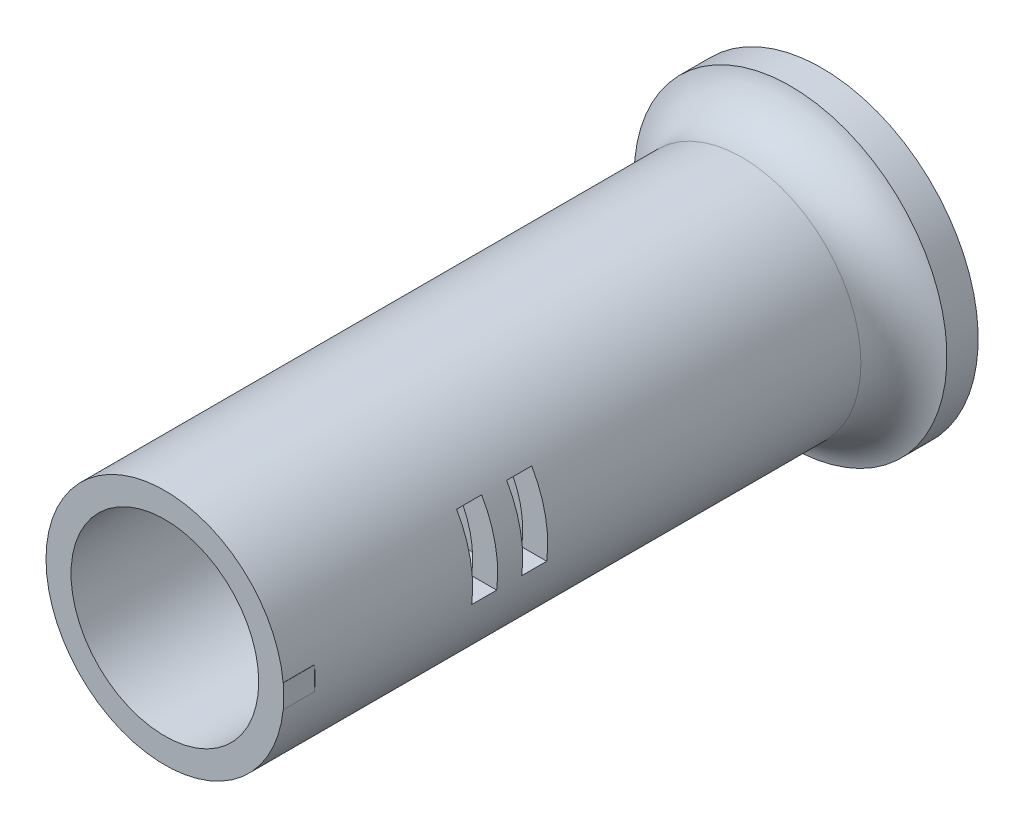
ISO-10303-21;
HEADER;
FILE_DESCRIPTION(('STEP AP214'),'2;1');
FILE_NAME('part.step','',(''),(''),'','','');
FILE_SCHEMA(('AUTOMOTIVE_DESIGN { 1 0 10303 214 1 1 1 1 }'));
ENDSEC;
DATA;
#1=APPLICATION_CONTEXT('core data for automotive mechanical design processes');
#2=APPLICATION_PROTOCOL_DEFINITION('international standard','automotive_design',2000,#1);
#3=PRODUCT_CONTEXT('',#1,'mechanical');
#4=PRODUCT('Part','Part','',(#3));
#5=PRODUCT_RELATED_PRODUCT_CATEGORY('part','',(#4));
#6=PRODUCT_DEFINITION_FORMATION('','',#4);
#7=PRODUCT_DEFINITION_CONTEXT('part definition',#1,'design');
#8=PRODUCT_DEFINITION('design','',#6,#7);
#9=PRODUCT_DEFINITION_SHAPE('','',#8);
#10=(LENGTH_UNIT() NAMED_UNIT(*) SI_UNIT(.MILLI.,.METRE.));
#11=(NAMED_UNIT(*) PLANE_ANGLE_UNIT() SI_UNIT($,.RADIAN.));
#12=(NAMED_UNIT(*) SI_UNIT($,.STERADIAN.) SOLID_ANGLE_UNIT());
#13=UNCERTAINTY_MEASURE_WITH_UNIT(LENGTH_MEASURE(1.E-05),#10,'distance_accuracy_value','');
#14=(GEOMETRIC_REPRESENTATION_CONTEXT(3) GLOBAL_UNCERTAINTY_ASSIGNED_CONTEXT((#13)) GLOBAL_UNIT_ASSIGNED_CONTEXT((#10,
#11,#12)) REPRESENTATION_CONTEXT('',''));
#15=CARTESIAN_POINT('',(0.,0.,0.));
#16=DIRECTION('',(0.,0.,1.));
#17=DIRECTION('',(1.,0.,0.));
#18=AXIS2_PLACEMENT_3D('',#15,#16,#17);
#19=CARTESIAN_POINT('',(0.,0.,120.65));
#20=DIRECTION('',(0.,0.,-1.));
#21=DIRECTION('',(-1.,0.,0.));
#22=AXIS2_PLACEMENT_3D('',#19,#20,#21);
#23=PLANE('',#22);
#24=DIRECTION('',(0.,1.,0.));
#25=VECTOR('',#24,1.);
#26=CARTESIAN_POINT('',(24.0565975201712,2.35496310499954,120.65));
#27=LINE('',#26,#25);
#28=CARTESIAN_POINT('',(24.0565975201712,-2.35496310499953,120.65));
#29=VERTEX_POINT('',#28);
#30=CARTESIAN_POINT('',(24.0565975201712,-1.88069555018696,120.65));
#31=VERTEX_POINT('',#30);
#32=EDGE_CURVE('E147',#29,#31,#27,.T.);
#33=ORIENTED_EDGE('',*,*,#32,.F.);
#34=DIRECTION('',(1.,0.,0.));
#35=VECTOR('',#34,1.);
#36=CARTESIAN_POINT('',(24.0148089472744,-2.35496310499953,120.65));
#37=LINE('',#36,#35);
#38=CARTESIAN_POINT('',(24.0148089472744,-2.35496310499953,120.65));
#39=VERTEX_POINT('',#38);
#40=EDGE_CURVE('E153',#39,#29,#37,.T.);
#41=ORIENTED_EDGE('',*,*,#40,.F.);
#42=CARTESIAN_POINT('',(0.,0.,120.65));
#43=DIRECTION('',(0.,0.,-1.));
#44=DIRECTION('',(-1.,0.,0.));
#45=AXIS2_PLACEMENT_3D('',#42,#43,#44);
#46=CIRCLE('',#45,24.13);
#47=EDGE_CURVE('E199',#31,#39,#46,.T.);
#48=ORIENTED_EDGE('',*,*,#47,.F.);
#49=EDGE_LOOP('',(#33,#41,#48));
#50=FACE_BOUND('',#49,.T.);
#51=ADVANCED_FACE('F38',(#50),#23,.T.);
#52=CARTESIAN_POINT('',(0.,0.,127.));
#53=DIRECTION('',(0.,0.,-1.));
#54=DIRECTION('',(-1.,0.,0.));
#55=AXIS2_PLACEMENT_3D('',#52,#53,#54);
#56=CYLINDRICAL_SURFACE('',#55,24.13);
#57=DIRECTION('',(0.,0.,-1.));
#58=VECTOR('',#57,1.);
#59=CARTESIAN_POINT('',(23.9259508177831,-3.13141780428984,127.));
#60=LINE('',#59,#58);
#61=CARTESIAN_POINT('',(23.9259508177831,-3.13141780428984,83.5679729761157));
#62=VERTEX_POINT('',#61);
#63=CARTESIAN_POINT('',(23.9259508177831,-3.13141780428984,88.6479729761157));
#64=VERTEX_POINT('',#63);
#65=EDGE_CURVE('E293',#62,#64,#60,.F.);
#66=ORIENTED_EDGE('',*,*,#65,.T.);
#67=CARTESIAN_POINT('',(0.,0.,88.6479729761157));
#68=DIRECTION('',(0.,0.,1.));
#69=DIRECTION('',(1.,0.,0.));
#70=AXIS2_PLACEMENT_3D('',#67,#68,#69);
#71=CIRCLE('',#70,24.13);
#72=CARTESIAN_POINT('',(20.8719701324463,12.1085821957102,88.6479729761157));
#73=VERTEX_POINT('',#72);
#74=EDGE_CURVE('E164',#64,#73,#71,.T.);
#75=ORIENTED_EDGE('',*,*,#74,.T.);
#76=DIRECTION('',(0.,0.,-1.));
#77=VECTOR('',#76,1.);
#78=CARTESIAN_POINT('',(20.8719701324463,12.1085821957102,127.));
#79=LINE('',#78,#77);
#80=CARTESIAN_POINT('',(20.8719701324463,12.1085821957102,83.5679729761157));
#81=VERTEX_POINT('',#80);
#82=EDGE_CURVE('E246',#73,#81,#79,.T.);
#83=ORIENTED_EDGE('',*,*,#82,.T.);
#84=CARTESIAN_POINT('',(0.,0.,83.5679729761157));
#85=DIRECTION('',(0.,0.,-1.));
#86=DIRECTION('',(-1.,0.,0.));
#87=AXIS2_PLACEMENT_3D('',#84,#85,#86);
#88=CIRCLE('',#87,24.13);
#89=EDGE_CURVE('E297',#81,#62,#88,.T.);
#90=ORIENTED_EDGE('',*,*,#89,.T.);
#91=EDGE_LOOP('',(#66,#75,#83,#90));
#92=FACE_BOUND('',#91,.T.);
#93=DIRECTION('',(0.,0.,-1.));
#94=VECTOR('',#93,1.);
#95=CARTESIAN_POINT('',(23.9259508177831,-3.13141780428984,127.));
#96=LINE('',#95,#94);
#97=CARTESIAN_POINT('',(23.9259508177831,-3.13141780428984,73.4079729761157));
#98=VERTEX_POINT('',#97);
#99=CARTESIAN_POINT('',(23.9259508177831,-3.13141780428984,78.4879729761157));
#100=VERTEX_POINT('',#99);
#101=EDGE_CURVE('E248',#98,#100,#96,.F.);
#102=ORIENTED_EDGE('',*,*,#101,.T.);
#103=CARTESIAN_POINT('',(0.,0.,78.4879729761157));
#104=DIRECTION('',(0.,0.,1.));
#105=DIRECTION('',(1.,0.,0.));
#106=AXIS2_PLACEMENT_3D('',#103,#104,#105);
#107=CIRCLE('',#106,24.13);
#108=CARTESIAN_POINT('',(20.8719701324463,12.1085821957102,78.4879729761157));
#109=VERTEX_POINT('',#108);
#110=EDGE_CURVE('E289',#100,#109,#107,.T.);
#111=ORIENTED_EDGE('',*,*,#110,.T.);
#112=DIRECTION('',(0.,0.,-1.));
#113=VECTOR('',#112,1.);
#114=CARTESIAN_POINT('',(20.8719701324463,12.1085821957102,127.));
#115=LINE('',#114,#113);
#116=CARTESIAN_POINT('',(20.8719701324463,12.1085821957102,73.4079729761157));
#117=VERTEX_POINT('',#116);
#118=EDGE_CURVE('E285',#109,#117,#115,.T.);
#119=ORIENTED_EDGE('',*,*,#118,.T.);
#120=CARTESIAN_POINT('',(0.,0.,73.4079729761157));
#121=DIRECTION('',(0.,0.,-1.));
#122=DIRECTION('',(-1.,0.,0.));
#123=AXIS2_PLACEMENT_3D('',#120,#121,#122);
#124=CIRCLE('',#123,24.13);
#125=EDGE_CURVE('E254',#117,#98,#124,.T.);
#126=ORIENTED_EDGE('',*,*,#125,.T.);
#127=EDGE_LOOP('',(#102,#111,#119,#126));
#128=FACE_BOUND('',#127,.T.);
#129=CARTESIAN_POINT('',(0.,0.,127.));
#130=DIRECTION('',(0.,0.,1.));
#131=DIRECTION('',(1.,0.,0.));
#132=AXIS2_PLACEMENT_3D('',#129,#130,#131);
#133=CIRCLE('',#132,24.13);
#134=CARTESIAN_POINT('',(24.0148089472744,2.35496310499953,127.));
#135=VERTEX_POINT('',#134);
#136=CARTESIAN_POINT('',(24.0148089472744,-2.35496310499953,127.));
#137=VERTEX_POINT('',#136);
#138=EDGE_CURVE('E188',#135,#137,#133,.T.);
#139=ORIENTED_EDGE('',*,*,#138,.F.);
#140=DIRECTION('',(0.,0.,1.));
#141=VECTOR('',#140,1.);
#142=CARTESIAN_POINT('',(24.0148089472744,2.35496310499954,120.65));
#143=LINE('',#142,#141);
#144=CARTESIAN_POINT('',(24.0148089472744,2.35496310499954,120.65));
#145=VERTEX_POINT('',#144);
#146=EDGE_CURVE('E159',#145,#135,#143,.T.);
#147=ORIENTED_EDGE('',*,*,#146,.F.);
#148=CARTESIAN_POINT('',(24.0565975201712,1.88069555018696,120.65));
#149=VERTEX_POINT('',#148);
#150=EDGE_CURVE('E150',#145,#149,#46,.T.);
#151=ORIENTED_EDGE('',*,*,#150,.T.);
#152=EDGE_CURVE('E203',#149,#31,#46,.T.);
#153=ORIENTED_EDGE('',*,*,#152,.T.);
#154=ORIENTED_EDGE('',*,*,#47,.T.);
#155=DIRECTION('',(0.,0.,1.));
#156=VECTOR('',#155,1.);
#157=CARTESIAN_POINT('',(24.0148089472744,-2.35496310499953,120.65));
#158=LINE('',#157,#156);
#159=EDGE_CURVE('E169',#39,#137,#158,.T.);
#160=ORIENTED_EDGE('',*,*,#159,.T.);
#161=EDGE_LOOP('',(#139,#147,#151,#153,#154,#160));
#162=FACE_BOUND('',#161,.T.);
#163=CARTESIAN_POINT('',(0.,0.,9.83737769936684));
#164=DIRECTION('',(0.,0.,-1.));
#165=DIRECTION('',(-1.,0.,0.));
#166=AXIS2_PLACEMENT_3D('',#163,#164,#165);
#167=CIRCLE('',#166,24.13);
#168=CARTESIAN_POINT('',(-24.13,0.,9.83737769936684));
#169=VERTEX_POINT('',#168);
#170=EDGE_CURVE('E195',#169,#169,#167,.F.);
#171=ORIENTED_EDGE('',*,*,#170,.T.);
#172=EDGE_LOOP('',(#171));
#173=FACE_BOUND('',#172,.T.);
#174=ADVANCED_FACE('F303',(#92,#128,#162,#173),#56,.T.);
#175=CARTESIAN_POINT('',(0.,0.,127.));
#176=DIRECTION('',(0.,0.,1.));
#177=DIRECTION('',(1.,0.,0.));
#178=AXIS2_PLACEMENT_3D('',#175,#176,#177);
#179=PLANE('',#178);
#180=DIRECTION('',(0.,-1.,0.));
#181=VECTOR('',#180,1.);
#182=CARTESIAN_POINT('',(24.0565975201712,2.35496310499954,127.));
#183=LINE('',#182,#181);
#184=CARTESIAN_POINT('',(24.0565975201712,2.35496310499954,127.));
#185=VERTEX_POINT('',#184);
#186=CARTESIAN_POINT('',(24.0565975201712,-2.35496310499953,127.));
#187=VERTEX_POINT('',#186);
#188=EDGE_CURVE('E146',#185,#187,#183,.T.);
#189=ORIENTED_EDGE('',*,*,#188,.F.);
#190=DIRECTION('',(-1.,0.,0.));
#191=VECTOR('',#190,1.);
#192=CARTESIAN_POINT('',(24.0148089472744,2.35496310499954,127.));
#193=LINE('',#192,#191);
#194=EDGE_CURVE('E144',#185,#135,#193,.T.);
#195=ORIENTED_EDGE('',*,*,#194,.T.);
#196=ORIENTED_EDGE('',*,*,#138,.T.);
#197=DIRECTION('',(1.,0.,0.));
#198=VECTOR('',#197,1.);
#199=CARTESIAN_POINT('',(24.0148089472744,-2.35496310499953,127.));
#200=LINE('',#199,#198);
#201=EDGE_CURVE('E154',#137,#187,#200,.T.);
#202=ORIENTED_EDGE('',*,*,#201,.T.);
#203=EDGE_LOOP('',(#189,#195,#196,#202));
#204=FACE_BOUND('',#203,.T.);
#205=CARTESIAN_POINT('',(0.,0.,127.));
#206=DIRECTION('',(0.,0.,1.));
#207=DIRECTION('',(1.,0.,0.));
#208=AXIS2_PLACEMENT_3D('',#205,#206,#207);
#209=CIRCLE('',#208,19.05);
#210=CARTESIAN_POINT('',(19.05,0.,127.));
#211=VERTEX_POINT('',#210);
#212=EDGE_CURVE('E180',#211,#211,#209,.T.);
#213=ORIENTED_EDGE('',*,*,#212,.F.);
#214=EDGE_LOOP('',(#213));
#215=FACE_BOUND('',#214,.T.);
#216=ADVANCED_FACE('F324',(#204,#215),#179,.T.);
#217=CARTESIAN_POINT('',(0.,0.,63.5));
#218=DIRECTION('',(0.,0.,1.));
#219=DIRECTION('',(1.,0.,0.));
#220=AXIS2_PLACEMENT_3D('',#217,#218,#219);
#221=CYLINDRICAL_SURFACE('',#220,19.05);
#222=DIRECTION('',(0.,0.,1.));
#223=VECTOR('',#222,1.);
#224=CARTESIAN_POINT('',(14.7066222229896,12.1085821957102,63.5));
#225=LINE('',#224,#223);
#226=CARTESIAN_POINT('',(14.7066222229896,12.1085821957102,83.5679729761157));
#227=VERTEX_POINT('',#226);
#228=CARTESIAN_POINT('',(14.7066222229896,12.1085821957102,88.6479729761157));
#229=VERTEX_POINT('',#228);
#230=EDGE_CURVE('E227',#227,#229,#225,.T.);
#231=ORIENTED_EDGE('',*,*,#230,.T.);
#232=CARTESIAN_POINT('',(0.,0.,88.6479729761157));
#233=DIRECTION('',(0.,0.,1.));
#234=DIRECTION('',(1.,0.,0.));
#235=AXIS2_PLACEMENT_3D('',#232,#233,#234);
#236=CIRCLE('',#235,19.05);
#237=CARTESIAN_POINT('',(18.7908680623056,-3.13141780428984,88.6479729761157));
#238=VERTEX_POINT('',#237);
#239=EDGE_CURVE('E47',#229,#238,#236,.F.);
#240=ORIENTED_EDGE('',*,*,#239,.T.);
#241=DIRECTION('',(0.,0.,1.));
#242=VECTOR('',#241,1.);
#243=CARTESIAN_POINT('',(18.7908680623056,-3.13141780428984,63.5));
#244=LINE('',#243,#242);
#245=CARTESIAN_POINT('',(18.7908680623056,-3.13141780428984,83.5679729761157));
#246=VERTEX_POINT('',#245);
#247=EDGE_CURVE('E219',#238,#246,#244,.F.);
#248=ORIENTED_EDGE('',*,*,#247,.T.);
#249=CARTESIAN_POINT('',(0.,0.,83.5679729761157));
#250=DIRECTION('',(0.,0.,-1.));
#251=DIRECTION('',(-1.,0.,0.));
#252=AXIS2_PLACEMENT_3D('',#249,#250,#251);
#253=CIRCLE('',#252,19.05);
#254=EDGE_CURVE('E223',#246,#227,#253,.F.);
#255=ORIENTED_EDGE('',*,*,#254,.T.);
#256=EDGE_LOOP('',(#231,#240,#248,#255));
#257=FACE_BOUND('',#256,.T.);
#258=DIRECTION('',(0.,0.,1.));
#259=VECTOR('',#258,1.);
#260=CARTESIAN_POINT('',(14.7066222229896,12.1085821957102,63.5));
#261=LINE('',#260,#259);
#262=CARTESIAN_POINT('',(14.7066222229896,12.1085821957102,73.4079729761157));
#263=VERTEX_POINT('',#262);
#264=CARTESIAN_POINT('',(14.7066222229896,12.1085821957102,78.4879729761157));
#265=VERTEX_POINT('',#264);
#266=EDGE_CURVE('E211',#263,#265,#261,.T.);
#267=ORIENTED_EDGE('',*,*,#266,.T.);
#268=CARTESIAN_POINT('',(0.,0.,78.4879729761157));
#269=DIRECTION('',(0.,0.,1.));
#270=DIRECTION('',(1.,0.,0.));
#271=AXIS2_PLACEMENT_3D('',#268,#269,#270);
#272=CIRCLE('',#271,19.05);
#273=CARTESIAN_POINT('',(18.7908680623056,-3.13141780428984,78.4879729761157));
#274=VERTEX_POINT('',#273);
#275=EDGE_CURVE('E215',#265,#274,#272,.F.);
#276=ORIENTED_EDGE('',*,*,#275,.T.);
#277=DIRECTION('',(0.,0.,1.));
#278=VECTOR('',#277,1.);
#279=CARTESIAN_POINT('',(18.7908680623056,-3.13141780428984,63.5));
#280=LINE('',#279,#278);
#281=CARTESIAN_POINT('',(18.7908680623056,-3.13141780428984,73.4079729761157));
#282=VERTEX_POINT('',#281);
#283=EDGE_CURVE('E202',#274,#282,#280,.F.);
#284=ORIENTED_EDGE('',*,*,#283,.T.);
#285=CARTESIAN_POINT('',(0.,0.,73.4079729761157));
#286=DIRECTION('',(0.,0.,-1.));
#287=DIRECTION('',(-1.,0.,0.));
#288=AXIS2_PLACEMENT_3D('',#285,#286,#287);
#289=CIRCLE('',#288,19.05);
#290=EDGE_CURVE('E207',#282,#263,#289,.F.);
#291=ORIENTED_EDGE('',*,*,#290,.T.);
#292=EDGE_LOOP('',(#267,#276,#284,#291));
#293=FACE_BOUND('',#292,.T.);
#294=CARTESIAN_POINT('',(0.,0.,63.5));
#295=DIRECTION('',(0.,0.,1.));
#296=DIRECTION('',(1.,0.,0.));
#297=AXIS2_PLACEMENT_3D('',#294,#295,#296);
#298=CIRCLE('',#297,19.05);
#299=CARTESIAN_POINT('',(19.05,0.,63.5));
#300=VERTEX_POINT('',#299);
#301=EDGE_CURVE('E184',#300,#300,#298,.T.);
#302=ORIENTED_EDGE('',*,*,#301,.F.);
#303=EDGE_LOOP('',(#302));
#304=FACE_BOUND('',#303,.T.);
#305=ORIENTED_EDGE('',*,*,#212,.T.);
#306=EDGE_LOOP('',(#305));
#307=FACE_BOUND('',#306,.T.);
#308=ADVANCED_FACE('F233',(#257,#293,#304,#307),#221,.F.);
#309=CARTESIAN_POINT('',(0.,0.,63.5));
#310=DIRECTION('',(0.,0.,1.));
#311=DIRECTION('',(1.,0.,0.));
#312=AXIS2_PLACEMENT_3D('',#309,#310,#311);
#313=PLANE('',#312);
#314=ORIENTED_EDGE('',*,*,#301,.T.);
#315=EDGE_LOOP('',(#314));
#316=FACE_BOUND('',#315,.T.);
#317=ADVANCED_FACE('F351',(#316),#313,.T.);
#318=CARTESIAN_POINT('',(0.,0.,-6.35));
#319=DIRECTION('',(0.,0.,1.));
#320=DIRECTION('',(1.,0.,0.));
#321=AXIS2_PLACEMENT_3D('',#318,#319,#320);
#322=CYLINDRICAL_SURFACE('',#321,31.75);
#323=CARTESIAN_POINT('',(0.,0.,-6.35));
#324=DIRECTION('',(0.,0.,-1.));
#325=DIRECTION('',(-1.,0.,0.));
#326=AXIS2_PLACEMENT_3D('',#323,#324,#325);
#327=CIRCLE('',#326,31.75);
#328=CARTESIAN_POINT('',(-31.75,0.,-6.35));
#329=VERTEX_POINT('',#328);
#330=EDGE_CURVE('E176',#329,#329,#327,.T.);
#331=ORIENTED_EDGE('',*,*,#330,.F.);
#332=EDGE_LOOP('',(#331));
#333=FACE_BOUND('',#332,.T.);
#334=CARTESIAN_POINT('',(0.,0.,0.));
#335=DIRECTION('',(0.,0.,-1.));
#336=DIRECTION('',(-1.,0.,0.));
#337=AXIS2_PLACEMENT_3D('',#334,#335,#336);
#338=CIRCLE('',#337,31.75);
#339=CARTESIAN_POINT('',(-31.75,0.,0.));
#340=VERTEX_POINT('',#339);
#341=EDGE_CURVE('E173',#340,#340,#338,.T.);
#342=ORIENTED_EDGE('',*,*,#341,.T.);
#343=EDGE_LOOP('',(#342));
#344=FACE_BOUND('',#343,.T.);
#345=ADVANCED_FACE('F347',(#333,#344),#322,.T.);
#346=CARTESIAN_POINT('',(0.,0.,-6.35));
#347=DIRECTION('',(0.,0.,-1.));
#348=DIRECTION('',(-1.,0.,0.));
#349=AXIS2_PLACEMENT_3D('',#346,#347,#348);
#350=PLANE('',#349);
#351=ORIENTED_EDGE('',*,*,#330,.T.);
#352=EDGE_LOOP('',(#351));
#353=FACE_BOUND('',#352,.T.);
#354=ADVANCED_FACE('F344',(#353),#350,.T.);
#355=CARTESIAN_POINT('',(0.,0.,9.83737769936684));
#356=DIRECTION('',(0.,0.,-1.));
#357=DIRECTION('',(-1.,0.,0.));
#358=AXIS2_PLACEMENT_3D('',#355,#356,#357);
#359=TOROIDAL_SURFACE('',#358,34.29,10.16);
#360=ORIENTED_EDGE('',*,*,#341,.F.);
#361=EDGE_LOOP('',(#360));
#362=FACE_BOUND('',#361,.T.);
#363=ORIENTED_EDGE('',*,*,#170,.F.);
#364=EDGE_LOOP('',(#363));
#365=FACE_BOUND('',#364,.T.);
#366=ADVANCED_FACE('F40',(#362,#365),#359,.F.);
#367=CARTESIAN_POINT('',(24.0148089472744,2.35496310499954,120.65));
#368=DIRECTION('',(0.,1.,0.));
#369=DIRECTION('',(0.,0.,1.));
#370=AXIS2_PLACEMENT_3D('',#367,#368,#369);
#371=PLANE('',#370);
#372=DIRECTION('',(0.,0.,1.));
#373=VECTOR('',#372,1.);
#374=CARTESIAN_POINT('',(24.0565975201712,2.35496310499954,120.65));
#375=LINE('',#374,#373);
#376=CARTESIAN_POINT('',(24.0565975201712,2.35496310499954,120.65));
#377=VERTEX_POINT('',#376);
#378=EDGE_CURVE('E133',#377,#185,#375,.T.);
#379=ORIENTED_EDGE('',*,*,#378,.F.);
#380=DIRECTION('',(-1.,0.,0.));
#381=VECTOR('',#380,1.);
#382=CARTESIAN_POINT('',(24.0148089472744,2.35496310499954,120.65));
#383=LINE('',#382,#381);
#384=EDGE_CURVE('E143',#377,#145,#383,.T.);
#385=ORIENTED_EDGE('',*,*,#384,.T.);
#386=ORIENTED_EDGE('',*,*,#146,.T.);
#387=ORIENTED_EDGE('',*,*,#194,.F.);
#388=EDGE_LOOP('',(#379,#385,#386,#387));
#389=FACE_BOUND('',#388,.T.);
#390=ADVANCED_FACE('F141',(#389),#371,.T.);
#391=CARTESIAN_POINT('',(24.0148089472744,-2.35496310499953,120.65));
#392=DIRECTION('',(0.,-1.,0.));
#393=DIRECTION('',(0.,0.,-1.));
#394=AXIS2_PLACEMENT_3D('',#391,#392,#393);
#395=PLANE('',#394);
#396=DIRECTION('',(0.,0.,-1.));
#397=VECTOR('',#396,1.);
#398=CARTESIAN_POINT('',(24.0565975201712,-2.35496310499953,120.65));
#399=LINE('',#398,#397);
#400=EDGE_CURVE('E259',#187,#29,#399,.T.);
#401=ORIENTED_EDGE('',*,*,#400,.F.);
#402=ORIENTED_EDGE('',*,*,#201,.F.);
#403=ORIENTED_EDGE('',*,*,#159,.F.);
#404=ORIENTED_EDGE('',*,*,#40,.T.);
#405=EDGE_LOOP('',(#401,#402,#403,#404));
#406=FACE_BOUND('',#405,.T.);
#407=ADVANCED_FACE('F330',(#406),#395,.T.);
#408=DIRECTION('',(0.,1.,0.));
#409=VECTOR('',#408,1.);
#410=CARTESIAN_POINT('',(24.0565975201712,0.,120.65));
#411=LINE('',#410,#409);
#412=EDGE_CURVE('E11',#149,#377,#411,.T.);
#413=ORIENTED_EDGE('',*,*,#412,.F.);
#414=ORIENTED_EDGE('',*,*,#150,.F.);
#415=ORIENTED_EDGE('',*,*,#384,.F.);
#416=EDGE_LOOP('',(#413,#414,#415));
#417=FACE_BOUND('',#416,.T.);
#418=ADVANCED_FACE('F149',(#417),#23,.T.);
#419=CARTESIAN_POINT('',(8.6260975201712,12.1085821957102,78.4879729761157));
#420=DIRECTION('',(0.,0.,1.));
#421=DIRECTION('',(1.,0.,0.));
#422=AXIS2_PLACEMENT_3D('',#419,#420,#421);
#423=PLANE('',#422);
#424=DIRECTION('',(1.,0.,0.));
#425=VECTOR('',#424,1.);
#426=CARTESIAN_POINT('',(8.6260975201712,-3.13141780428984,78.4879729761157));
#427=LINE('',#426,#425);
#428=EDGE_CURVE('E279',#274,#100,#427,.T.);
#429=ORIENTED_EDGE('',*,*,#428,.F.);
#430=ORIENTED_EDGE('',*,*,#275,.F.);
#431=DIRECTION('',(1.,0.,0.));
#432=VECTOR('',#431,1.);
#433=CARTESIAN_POINT('',(8.6260975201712,12.1085821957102,78.4879729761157));
#434=LINE('',#433,#432);
#435=EDGE_CURVE('E267',#265,#109,#434,.T.);
#436=ORIENTED_EDGE('',*,*,#435,.T.);
#437=ORIENTED_EDGE('',*,*,#110,.F.);
#438=EDGE_LOOP('',(#429,#430,#436,#437));
#439=FACE_BOUND('',#438,.T.);
#440=ADVANCED_FACE('F329',(#439),#423,.F.);
#441=CARTESIAN_POINT('',(8.6260975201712,12.1085821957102,78.4879729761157));
#442=DIRECTION('',(0.,1.,0.));
#443=DIRECTION('',(0.,0.,1.));
#444=AXIS2_PLACEMENT_3D('',#441,#442,#443);
#445=PLANE('',#444);
#446=ORIENTED_EDGE('',*,*,#435,.F.);
#447=ORIENTED_EDGE('',*,*,#266,.F.);
#448=DIRECTION('',(1.,0.,0.));
#449=VECTOR('',#448,1.);
#450=CARTESIAN_POINT('',(8.6260975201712,12.1085821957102,73.4079729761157));
#451=LINE('',#450,#449);
#452=EDGE_CURVE('E271',#263,#117,#451,.T.);
#453=ORIENTED_EDGE('',*,*,#452,.T.);
#454=ORIENTED_EDGE('',*,*,#118,.F.);
#455=EDGE_LOOP('',(#446,#447,#453,#454));
#456=FACE_BOUND('',#455,.T.);
#457=ADVANCED_FACE('F335',(#456),#445,.F.);
#458=CARTESIAN_POINT('',(8.6260975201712,12.1085821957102,73.4079729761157));
#459=DIRECTION('',(0.,0.,-1.));
#460=DIRECTION('',(-1.,0.,0.));
#461=AXIS2_PLACEMENT_3D('',#458,#459,#460);
#462=PLANE('',#461);
#463=ORIENTED_EDGE('',*,*,#452,.F.);
#464=ORIENTED_EDGE('',*,*,#290,.F.);
#465=DIRECTION('',(1.,0.,0.));
#466=VECTOR('',#465,1.);
#467=CARTESIAN_POINT('',(8.6260975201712,-3.13141780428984,73.4079729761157));
#468=LINE('',#467,#466);
#469=EDGE_CURVE('E275',#282,#98,#468,.T.);
#470=ORIENTED_EDGE('',*,*,#469,.T.);
#471=ORIENTED_EDGE('',*,*,#125,.F.);
#472=EDGE_LOOP('',(#463,#464,#470,#471));
#473=FACE_BOUND('',#472,.T.);
#474=ADVANCED_FACE('F458',(#473),#462,.F.);
#475=CARTESIAN_POINT('',(8.6260975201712,-3.13141780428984,78.4879729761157));
#476=DIRECTION('',(0.,-1.,0.));
#477=DIRECTION('',(0.,0.,-1.));
#478=AXIS2_PLACEMENT_3D('',#475,#476,#477);
#479=PLANE('',#478);
#480=ORIENTED_EDGE('',*,*,#469,.F.);
#481=ORIENTED_EDGE('',*,*,#283,.F.);
#482=ORIENTED_EDGE('',*,*,#428,.T.);
#483=ORIENTED_EDGE('',*,*,#101,.F.);
#484=EDGE_LOOP('',(#480,#481,#482,#483));
#485=FACE_BOUND('',#484,.T.);
#486=ADVANCED_FACE('F449',(#485),#479,.F.);
#487=CARTESIAN_POINT('',(8.6260975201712,12.1085821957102,88.6479729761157));
#488=DIRECTION('',(0.,0.,1.));
#489=DIRECTION('',(1.,0.,0.));
#490=AXIS2_PLACEMENT_3D('',#487,#488,#489);
#491=PLANE('',#490);
#492=DIRECTION('',(1.,0.,0.));
#493=VECTOR('',#492,1.);
#494=CARTESIAN_POINT('',(8.6260975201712,-3.13141780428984,88.6479729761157));
#495=LINE('',#494,#493);
#496=EDGE_CURVE('E61',#238,#64,#495,.T.);
#497=ORIENTED_EDGE('',*,*,#496,.F.);
#498=ORIENTED_EDGE('',*,*,#239,.F.);
#499=DIRECTION('',(1.,0.,0.));
#500=VECTOR('',#499,1.);
#501=CARTESIAN_POINT('',(8.6260975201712,12.1085821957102,88.6479729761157));
#502=LINE('',#501,#500);
#503=EDGE_CURVE('E239',#229,#73,#502,.T.);
#504=ORIENTED_EDGE('',*,*,#503,.T.);
#505=ORIENTED_EDGE('',*,*,#74,.F.);
#506=EDGE_LOOP('',(#497,#498,#504,#505));
#507=FACE_BOUND('',#506,.T.);
#508=ADVANCED_FACE('F238',(#507),#491,.F.);
#509=CARTESIAN_POINT('',(8.6260975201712,12.1085821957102,88.6479729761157));
#510=DIRECTION('',(0.,1.,0.));
#511=DIRECTION('',(0.,0.,1.));
#512=AXIS2_PLACEMENT_3D('',#509,#510,#511);
#513=PLANE('',#512);
#514=ORIENTED_EDGE('',*,*,#503,.F.);
#515=ORIENTED_EDGE('',*,*,#230,.F.);
#516=DIRECTION('',(1.,0.,0.));
#517=VECTOR('',#516,1.);
#518=CARTESIAN_POINT('',(8.6260975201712,12.1085821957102,83.5679729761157));
#519=LINE('',#518,#517);
#520=EDGE_CURVE('E249',#227,#81,#519,.T.);
#521=ORIENTED_EDGE('',*,*,#520,.T.);
#522=ORIENTED_EDGE('',*,*,#82,.F.);
#523=EDGE_LOOP('',(#514,#515,#521,#522));
#524=FACE_BOUND('',#523,.T.);
#525=ADVANCED_FACE('F242',(#524),#513,.F.);
#526=CARTESIAN_POINT('',(8.6260975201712,12.1085821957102,83.5679729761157));
#527=DIRECTION('',(0.,0.,-1.));
#528=DIRECTION('',(-1.,0.,0.));
#529=AXIS2_PLACEMENT_3D('',#526,#527,#528);
#530=PLANE('',#529);
#531=ORIENTED_EDGE('',*,*,#520,.F.);
#532=ORIENTED_EDGE('',*,*,#254,.F.);
#533=DIRECTION('',(1.,0.,0.));
#534=VECTOR('',#533,1.);
#535=CARTESIAN_POINT('',(8.6260975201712,-3.13141780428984,83.5679729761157));
#536=LINE('',#535,#534);
#537=EDGE_CURVE('E256',#246,#62,#536,.T.);
#538=ORIENTED_EDGE('',*,*,#537,.T.);
#539=ORIENTED_EDGE('',*,*,#89,.F.);
#540=EDGE_LOOP('',(#531,#532,#538,#539));
#541=FACE_BOUND('',#540,.T.);
#542=ADVANCED_FACE('F308',(#541),#530,.F.);
#543=CARTESIAN_POINT('',(8.6260975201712,-3.13141780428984,88.6479729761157));
#544=DIRECTION('',(0.,-1.,0.));
#545=DIRECTION('',(0.,0.,-1.));
#546=AXIS2_PLACEMENT_3D('',#543,#544,#545);
#547=PLANE('',#546);
#548=ORIENTED_EDGE('',*,*,#537,.F.);
#549=ORIENTED_EDGE('',*,*,#247,.F.);
#550=ORIENTED_EDGE('',*,*,#496,.T.);
#551=ORIENTED_EDGE('',*,*,#65,.F.);
#552=EDGE_LOOP('',(#548,#549,#550,#551));
#553=FACE_BOUND('',#552,.T.);
#554=ADVANCED_FACE('F305',(#553),#547,.F.);
#555=CARTESIAN_POINT('',(24.0565975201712,2.35496310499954,120.65));
#556=DIRECTION('',(0.,0.,-1.));
#557=DIRECTION('',(-1.,0.,0.));
#558=AXIS2_PLACEMENT_3D('',#555,#556,#557);
#559=PLANE('',#558);
#560=EDGE_CURVE('E53',#31,#149,#27,.T.);
#561=ORIENTED_EDGE('',*,*,#560,.F.);
#562=ORIENTED_EDGE('',*,*,#152,.F.);
#563=EDGE_LOOP('',(#561,#562));
#564=FACE_BOUND('',#563,.T.);
#565=ADVANCED_FACE('F315',(#564),#559,.F.);
#566=CARTESIAN_POINT('',(24.0565975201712,0.,0.));
#567=DIRECTION('',(-1.,0.,0.));
#568=DIRECTION('',(0.,0.,1.));
#569=AXIS2_PLACEMENT_3D('',#566,#567,#568);
#570=PLANE('',#569);
#571=ORIENTED_EDGE('',*,*,#32,.T.);
#572=ORIENTED_EDGE('',*,*,#560,.T.);
#573=ORIENTED_EDGE('',*,*,#412,.T.);
#574=ORIENTED_EDGE('',*,*,#378,.T.);
#575=ORIENTED_EDGE('',*,*,#188,.T.);
#576=ORIENTED_EDGE('',*,*,#400,.T.);
#577=EDGE_LOOP('',(#571,#572,#573,#574,#575,#576));
#578=FACE_BOUND('',#577,.T.);
#579=ADVANCED_FACE('F132',(#578),#570,.F.);
#580=CLOSED_SHELL('',(#51,#174,#216,#308,#317,#345,#354,#366,#390,#407,#418,#440,#457,#474,#486,
#508,#525,#542,#554,#565,#579));
#581=MANIFOLD_SOLID_BREP('B2',#580);
#582=ADVANCED_BREP_SHAPE_REPRESENTATION('',(#18,#581),#14);
#583=SHAPE_DEFINITION_REPRESENTATION(#9,#582);
ENDSEC;
END-ISO-10303-21;
